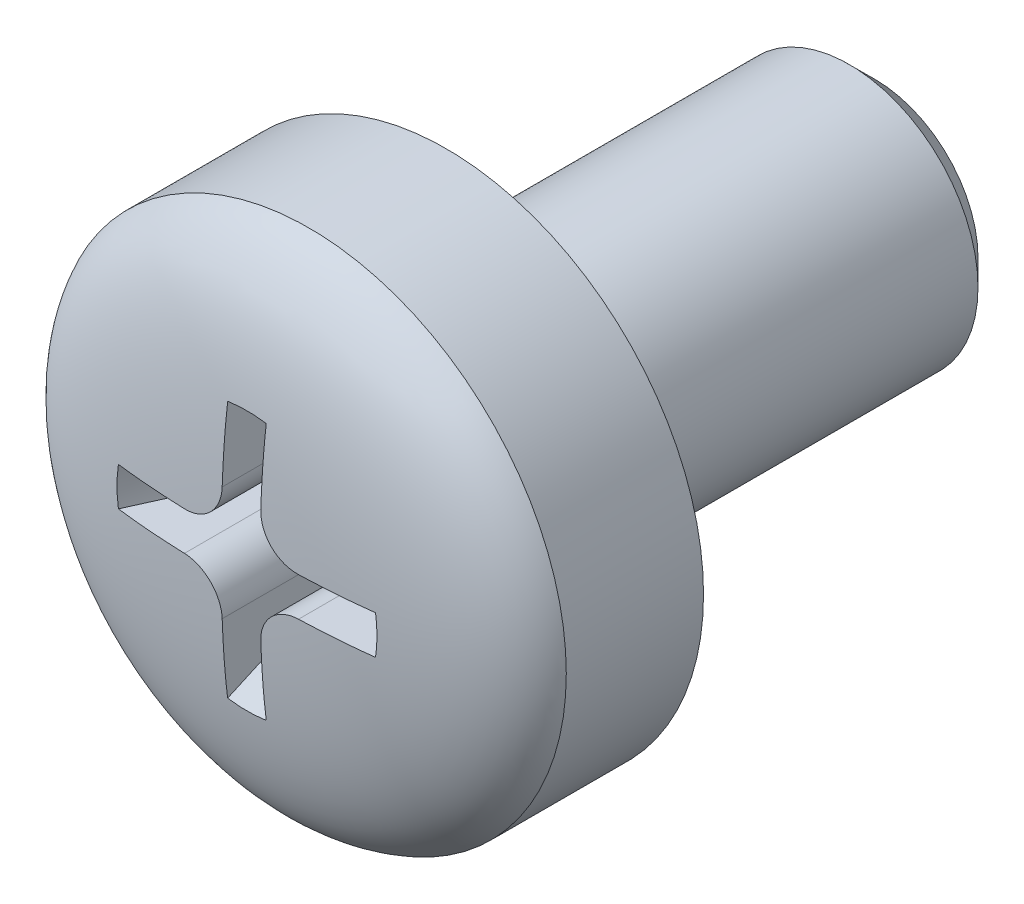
ISO-10303-21;
HEADER;
FILE_DESCRIPTION(('STEP AP214'),'2;1');
FILE_NAME('part.step','',(''),(''),'','','');
FILE_SCHEMA(('AUTOMOTIVE_DESIGN { 1 0 10303 214 1 1 1 1 }'));
ENDSEC;
DATA;
#1=APPLICATION_CONTEXT('core data for automotive mechanical design processes');
#2=APPLICATION_PROTOCOL_DEFINITION('international standard','automotive_design',2000,#1);
#3=PRODUCT_CONTEXT('',#1,'mechanical');
#4=PRODUCT('Part','Part','',(#3));
#5=PRODUCT_RELATED_PRODUCT_CATEGORY('part','',(#4));
#6=PRODUCT_DEFINITION_FORMATION('','',#4);
#7=PRODUCT_DEFINITION_CONTEXT('part definition',#1,'design');
#8=PRODUCT_DEFINITION('design','',#6,#7);
#9=PRODUCT_DEFINITION_SHAPE('','',#8);
#10=(LENGTH_UNIT() NAMED_UNIT(*) SI_UNIT(.MILLI.,.METRE.));
#11=(NAMED_UNIT(*) PLANE_ANGLE_UNIT() SI_UNIT($,.RADIAN.));
#12=(NAMED_UNIT(*) SI_UNIT($,.STERADIAN.) SOLID_ANGLE_UNIT());
#13=UNCERTAINTY_MEASURE_WITH_UNIT(LENGTH_MEASURE(1.E-05),#10,'distance_accuracy_value','');
#14=(GEOMETRIC_REPRESENTATION_CONTEXT(3) GLOBAL_UNCERTAINTY_ASSIGNED_CONTEXT((#13)) GLOBAL_UNIT_ASSIGNED_CONTEXT((#10,
#11,#12)) REPRESENTATION_CONTEXT('',''));
#15=CARTESIAN_POINT('',(0.,0.,0.));
#16=DIRECTION('',(0.,0.,1.));
#17=DIRECTION('',(1.,0.,0.));
#18=AXIS2_PLACEMENT_3D('',#15,#16,#17);
#19=CARTESIAN_POINT('',(0.,0.,0.4));
#20=DIRECTION('',(0.,0.,1.));
#21=DIRECTION('',(1.,0.,0.));
#22=AXIS2_PLACEMENT_3D('',#19,#20,#21);
#23=PLANE('',#22);
#24=CARTESIAN_POINT('',(0.,0.,0.4));
#25=DIRECTION('',(0.,0.,1.));
#26=DIRECTION('',(1.,0.,0.));
#27=AXIS2_PLACEMENT_3D('',#24,#25,#26);
#28=CIRCLE('',#27,0.66);
#29=CARTESIAN_POINT('',(0.619607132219,-0.227347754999,0.4));
#30=VERTEX_POINT('',#29);
#31=CARTESIAN_POINT('',(0.66,0.,0.4));
#32=VERTEX_POINT('',#31);
#33=EDGE_CURVE('E411',#30,#32,#28,.T.);
#34=ORIENTED_EDGE('',*,*,#33,.T.);
#35=CARTESIAN_POINT('',(0.,0.,0.4));
#36=DIRECTION('',(0.,0.,1.));
#37=DIRECTION('',(1.,0.,0.));
#38=AXIS2_PLACEMENT_3D('',#35,#36,#37);
#39=CIRCLE('',#38,0.66);
#40=CARTESIAN_POINT('',(0.619607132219,0.227347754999,0.4));
#41=VERTEX_POINT('',#40);
#42=EDGE_CURVE('E10',#32,#41,#39,.T.);
#43=ORIENTED_EDGE('',*,*,#42,.T.);
#44=CARTESIAN_POINT('',(0.665,0.665,0.4));
#45=DIRECTION('',(0.,0.,1.));
#46=DIRECTION('',(1.,0.,0.));
#47=AXIS2_PLACEMENT_3D('',#44,#45,#46);
#48=CIRCLE('',#47,0.44);
#49=CARTESIAN_POINT('',(0.227347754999,0.619607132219,0.4));
#50=VERTEX_POINT('',#49);
#51=EDGE_CURVE('E509',#50,#41,#48,.T.);
#52=ORIENTED_EDGE('',*,*,#51,.F.);
#53=CARTESIAN_POINT('',(0.,0.,0.4));
#54=DIRECTION('',(0.,0.,1.));
#55=DIRECTION('',(1.,0.,0.));
#56=AXIS2_PLACEMENT_3D('',#53,#54,#55);
#57=CIRCLE('',#56,0.66);
#58=CARTESIAN_POINT('',(-0.227347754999,0.619607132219,0.4));
#59=VERTEX_POINT('',#58);
#60=EDGE_CURVE('E458',#50,#59,#57,.T.);
#61=ORIENTED_EDGE('',*,*,#60,.T.);
#62=CARTESIAN_POINT('',(-0.665,0.665,0.4));
#63=DIRECTION('',(0.,0.,1.));
#64=DIRECTION('',(1.,0.,0.));
#65=AXIS2_PLACEMENT_3D('',#62,#63,#64);
#66=CIRCLE('',#65,0.44);
#67=CARTESIAN_POINT('',(-0.619607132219,0.227347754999,0.4));
#68=VERTEX_POINT('',#67);
#69=EDGE_CURVE('E493',#68,#59,#66,.T.);
#70=ORIENTED_EDGE('',*,*,#69,.F.);
#71=CARTESIAN_POINT('',(0.,0.,0.4));
#72=DIRECTION('',(0.,0.,1.));
#73=DIRECTION('',(1.,0.,0.));
#74=AXIS2_PLACEMENT_3D('',#71,#72,#73);
#75=CIRCLE('',#74,0.66);
#76=CARTESIAN_POINT('',(-0.619607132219,-0.227347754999,0.4));
#77=VERTEX_POINT('',#76);
#78=EDGE_CURVE('E282',#68,#77,#75,.T.);
#79=ORIENTED_EDGE('',*,*,#78,.T.);
#80=CARTESIAN_POINT('',(-0.665,-0.665,0.4));
#81=DIRECTION('',(0.,0.,1.));
#82=DIRECTION('',(1.,0.,0.));
#83=AXIS2_PLACEMENT_3D('',#80,#81,#82);
#84=CIRCLE('',#83,0.44);
#85=CARTESIAN_POINT('',(-0.227347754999,-0.619607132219,0.4));
#86=VERTEX_POINT('',#85);
#87=EDGE_CURVE('E369',#86,#77,#84,.T.);
#88=ORIENTED_EDGE('',*,*,#87,.F.);
#89=CARTESIAN_POINT('',(0.,0.,0.4));
#90=DIRECTION('',(0.,0.,1.));
#91=DIRECTION('',(1.,0.,0.));
#92=AXIS2_PLACEMENT_3D('',#89,#90,#91);
#93=CIRCLE('',#92,0.66);
#94=CARTESIAN_POINT('',(0.227347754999,-0.619607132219,0.4));
#95=VERTEX_POINT('',#94);
#96=EDGE_CURVE('E435',#86,#95,#93,.T.);
#97=ORIENTED_EDGE('',*,*,#96,.T.);
#98=CARTESIAN_POINT('',(0.665,-0.665,0.4));
#99=DIRECTION('',(0.,0.,1.));
#100=DIRECTION('',(1.,0.,0.));
#101=AXIS2_PLACEMENT_3D('',#98,#99,#100);
#102=CIRCLE('',#101,0.44);
#103=EDGE_CURVE('E420',#30,#95,#102,.T.);
#104=ORIENTED_EDGE('',*,*,#103,.F.);
#105=EDGE_LOOP('',(#34,#43,#52,#61,#70,#79,#88,#97,#104));
#106=FACE_BOUND('',#105,.T.);
#107=ADVANCED_FACE('F16',(#106),#23,.T.);
#108=CARTESIAN_POINT('',(0.,0.,0.4));
#109=DIRECTION('',(0.,0.,1.));
#110=DIRECTION('',(1.,0.,0.));
#111=AXIS2_PLACEMENT_3D('',#108,#109,#110);
#112=CONICAL_SURFACE('',#111,0.66,0.418688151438);
#113=CARTESIAN_POINT('',(0.665000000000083,0.225,0.494455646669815));
#114=CARTESIAN_POINT('',(0.928989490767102,0.225,1.05639686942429));
#115=CARTESIAN_POINT('',(1.49897087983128,0.225,2.32306383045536));
#116=(BOUNDED_CURVE() B_SPLINE_CURVE(2,(#113,#114,#115),.UNSPECIFIED.,.F.,
.F.) B_SPLINE_CURVE_WITH_KNOTS((3,3),(0.,1.),
.UNSPECIFIED.) CURVE() GEOMETRIC_REPRESENTATION_ITEM() RATIONAL_B_SPLINE_CURVE((1.,
1.07920837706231,1.)) REPRESENTATION_ITEM(''));
#117=CARTESIAN_POINT('',(0.665,0.225,0.49445564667));
#118=VERTEX_POINT('',#117);
#119=CARTESIAN_POINT('',(1.498970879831,0.225,2.323063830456));
#120=VERTEX_POINT('',#119);
#121=EDGE_CURVE('E20',#118,#120,#116,.T.);
#122=ORIENTED_EDGE('',*,*,#121,.F.);
#123=CARTESIAN_POINT('',(0.619607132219,0.227347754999,0.4));
#124=CARTESIAN_POINT('',(0.631098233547,0.226155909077,0.423319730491));
#125=CARTESIAN_POINT('',(0.642491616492,0.225380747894,0.446872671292));
#126=CARTESIAN_POINT('',(0.653791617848,0.225000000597,0.470596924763));
#127=CARTESIAN_POINT('',(0.665,0.225,0.49445564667));
#128=(BOUNDED_CURVE() B_SPLINE_CURVE(4,(#123,#124,#125,#126,#127),.UNSPECIFIED.,.F.,
.F.) B_SPLINE_CURVE_WITH_KNOTS((5,5),(0.,1.),
.UNSPECIFIED.) CURVE() GEOMETRIC_REPRESENTATION_ITEM() RATIONAL_B_SPLINE_CURVE((1.,1.,1.,1.,1.)) REPRESENTATION_ITEM(''));
#129=EDGE_CURVE('E511',#41,#118,#128,.T.);
#130=ORIENTED_EDGE('',*,*,#129,.F.);
#131=ORIENTED_EDGE('',*,*,#42,.F.);
#132=DIRECTION('',(0.406562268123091,0.,0.913623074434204));
#133=VECTOR('',#132,1.);
#134=CARTESIAN_POINT('',(0.66,0.,0.4));
#135=LINE('',#134,#133);
#136=CARTESIAN_POINT('',(1.515763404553,0.,2.323063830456));
#137=VERTEX_POINT('',#136);
#138=EDGE_CURVE('E404',#32,#137,#135,.T.);
#139=ORIENTED_EDGE('',*,*,#138,.T.);
#140=CARTESIAN_POINT('',(1.42299669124,0.522129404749,2.323063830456));
#141=CARTESIAN_POINT('',(1.459719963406,0.422044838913,2.323063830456));
#142=CARTESIAN_POINT('',(1.487644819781,0.318729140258,2.323063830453));
#143=CARTESIAN_POINT('',(1.506390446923,0.213221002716,2.323063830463));
#144=CARTESIAN_POINT('',(1.515763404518,0.106609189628,2.323063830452));
#145=CARTESIAN_POINT('',(1.515763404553,0.,2.323063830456));
#146=(BOUNDED_CURVE() B_SPLINE_CURVE(5,(#140,#141,#142,#143,#144,#145),.UNSPECIFIED.,.F.,
.F.) B_SPLINE_CURVE_WITH_KNOTS((6,6),(0.,1.),
.UNSPECIFIED.) CURVE() GEOMETRIC_REPRESENTATION_ITEM() RATIONAL_B_SPLINE_CURVE((1.,1.,1.,1.,1.,1.)) REPRESENTATION_ITEM(''));
#147=EDGE_CURVE('E357',#120,#137,#146,.T.);
#148=ORIENTED_EDGE('',*,*,#147,.F.);
#149=EDGE_LOOP('',(#122,#130,#131,#139,#148));
#150=FACE_BOUND('',#149,.T.);
#151=ADVANCED_FACE('F18',(#150),#112,.F.);
#152=CARTESIAN_POINT('',(0.665,0.225,0.4));
#153=DIRECTION('',(0.,1.,0.));
#154=DIRECTION('',(1.,0.,0.));
#155=AXIS2_PLACEMENT_3D('',#152,#153,#154);
#156=PLANE('',#155);
#157=CARTESIAN_POINT('',(0.665,0.225,2.386872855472));
#158=CARTESIAN_POINT('',(0.726071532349,0.225,2.384557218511));
#159=CARTESIAN_POINT('',(0.788941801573,0.225,2.381864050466));
#160=CARTESIAN_POINT('',(0.852957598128,0.225,2.37876353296));
#161=CARTESIAN_POINT('',(0.917614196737,0.225,2.375230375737));
#162=CARTESIAN_POINT('',(0.982606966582,0.225,2.371239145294));
#163=CARTESIAN_POINT('',(1.047787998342,0.225,2.36675746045));
#164=CARTESIAN_POINT('',(1.157160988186,0.225,2.358350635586));
#165=CARTESIAN_POINT('',(1.201209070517,0.225,2.354725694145));
#166=CARTESIAN_POINT('',(1.245282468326,0.225,2.350844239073));
#167=CARTESIAN_POINT('',(1.289356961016,0.225,2.346692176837));
#168=CARTESIAN_POINT('',(1.333412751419,0.225,2.342254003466));
#169=CARTESIAN_POINT('',(1.377433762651,0.225,2.337512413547));
#170=CARTESIAN_POINT('',(1.437455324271,0.225,2.330599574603));
#171=CARTESIAN_POINT('',(1.453497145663,0.225,2.328708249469));
#172=CARTESIAN_POINT('',(1.469531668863,0.225,2.326773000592));
#173=CARTESIAN_POINT('',(1.485558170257,0.225,2.324792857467));
#174=CARTESIAN_POINT('',(1.501575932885,0.225,2.322766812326));
#175=CARTESIAN_POINT('',(1.517584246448,0.225,2.32069382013));
#176=CARTESIAN_POINT('',(1.533582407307,0.225,2.318572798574));
#177=(BOUNDED_CURVE() B_SPLINE_CURVE(7,(#157,#158,#159,#160,#161,#162,#163,#164,#165,#166,#167,
#168,#169,#170,#171,#172,#173,#174,#175,#176),.UNSPECIFIED.,.F.,
.F.) B_SPLINE_CURVE_WITH_KNOTS((8,6,6,8),(0.,0.521248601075,0.871992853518,1.),
.UNSPECIFIED.) CURVE() GEOMETRIC_REPRESENTATION_ITEM() RATIONAL_B_SPLINE_CURVE((1.,1.,1.,1.,1.,
1.,1.,1.,1.,1.,1.,1.,1.,1.,1.,1.,1.,1.,1.,1.)) REPRESENTATION_ITEM(''));
#178=CARTESIAN_POINT('',(0.665,0.225,2.386872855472));
#179=VERTEX_POINT('',#178);
#180=EDGE_CURVE('E350',#179,#120,#177,.T.);
#181=ORIENTED_EDGE('',*,*,#180,.F.);
#182=DIRECTION('',(0.,0.,1.));
#183=VECTOR('',#182,1.);
#184=CARTESIAN_POINT('',(0.665,0.225,0.4));
#185=LINE('',#184,#183);
#186=EDGE_CURVE('E516',#118,#179,#185,.T.);
#187=ORIENTED_EDGE('',*,*,#186,.F.);
#188=ORIENTED_EDGE('',*,*,#121,.T.);
#189=EDGE_LOOP('',(#181,#187,#188));
#190=FACE_BOUND('',#189,.T.);
#191=ADVANCED_FACE('F620',(#190),#156,.F.);
#192=CARTESIAN_POINT('',(0.665,0.665,0.4));
#193=DIRECTION('',(0.,0.,-1.));
#194=DIRECTION('',(1.,0.,0.));
#195=AXIS2_PLACEMENT_3D('',#192,#193,#194);
#196=CYLINDRICAL_SURFACE('',#195,0.44);
#197=ORIENTED_EDGE('',*,*,#51,.T.);
#198=ORIENTED_EDGE('',*,*,#129,.T.);
#199=ORIENTED_EDGE('',*,*,#186,.T.);
#200=CARTESIAN_POINT('',(0.353873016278,0.353873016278,2.393543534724));
#201=CARTESIAN_POINT('',(0.37187081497,0.335875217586,2.393543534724));
#202=CARTESIAN_POINT('',(0.391072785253,0.319102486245,2.393457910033));
#203=CARTESIAN_POINT('',(0.411602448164,0.303426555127,2.393286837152));
#204=CARTESIAN_POINT('',(0.433623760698,0.288838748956,2.393024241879));
#205=CARTESIAN_POINT('',(0.457308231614,0.275435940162,2.39265960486));
#206=CARTESIAN_POINT('',(0.48275831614,0.263468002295,2.392178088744));
#207=CARTESIAN_POINT('',(0.529863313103,0.245721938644,2.391118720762));
#208=CARTESIAN_POINT('',(0.550753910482,0.239143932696,2.390599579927));
#209=CARTESIAN_POINT('',(0.572481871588,0.233654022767,2.390006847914));
#210=CARTESIAN_POINT('',(0.594939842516,0.22939095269,2.389337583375));
#211=CARTESIAN_POINT('',(0.617975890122,0.226476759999,2.388590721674));
#212=CARTESIAN_POINT('',(0.641399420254,0.225,2.387767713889));
#213=CARTESIAN_POINT('',(0.665,0.225,2.386872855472));
#214=(BOUNDED_CURVE() B_SPLINE_CURVE(7,(#200,#201,#202,#203,#204,#205,#206,#207,#208,#209,#210,
#211,#212,#213),.UNSPECIFIED.,.F.,.F.) B_SPLINE_CURVE_WITH_KNOTS((8,6,8),(0.,0.575767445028,1.),
.UNSPECIFIED.) CURVE() GEOMETRIC_REPRESENTATION_ITEM() RATIONAL_B_SPLINE_CURVE((1.,1.,1.,1.,1.,
1.,1.,1.,1.,1.,1.,1.,1.,1.)) REPRESENTATION_ITEM(''));
#215=CARTESIAN_POINT('',(0.353873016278,0.353873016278,2.393543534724));
#216=VERTEX_POINT('',#215);
#217=EDGE_CURVE('E336',#216,#179,#214,.T.);
#218=ORIENTED_EDGE('',*,*,#217,.F.);
#219=CARTESIAN_POINT('',(0.225,0.665,2.386872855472));
#220=CARTESIAN_POINT('',(0.225,0.651787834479,2.387373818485));
#221=CARTESIAN_POINT('',(0.225476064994,0.638637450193,2.387851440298));
#222=CARTESIAN_POINT('',(0.226419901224,0.625585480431,2.388305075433));
#223=CARTESIAN_POINT('',(0.227818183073,0.61266787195,2.388734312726));
#224=CARTESIAN_POINT('',(0.22965303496,0.599918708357,2.389138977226));
#225=CARTESIAN_POINT('',(0.236604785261,0.561135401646,2.390313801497));
#226=CARTESIAN_POINT('',(0.243121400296,0.53575915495,2.391001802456));
#227=CARTESIAN_POINT('',(0.251251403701,0.51155486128,2.391582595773));
#228=CARTESIAN_POINT('',(0.260721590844,0.488669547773,2.392064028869));
#229=CARTESIAN_POINT('',(0.271319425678,0.467107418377,2.39245553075));
#230=CARTESIAN_POINT('',(0.293000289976,0.429138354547,2.393035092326));
#231=CARTESIAN_POINT('',(0.303848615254,0.412419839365,2.393242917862));
#232=CARTESIAN_POINT('',(0.315369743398,0.396608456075,2.393394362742));
#233=CARTESIAN_POINT('',(0.327531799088,0.381625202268,2.393493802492));
#234=CARTESIAN_POINT('',(0.34034822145,0.367397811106,2.393543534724));
#235=CARTESIAN_POINT('',(0.353873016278,0.353873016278,2.393543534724));
#236=(BOUNDED_CURVE() B_SPLINE_CURVE(6,(#219,#220,#221,#222,#223,#224,#225,#226,#227,#228,#229,
#230,#231,#232,#233,#234,#235),.UNSPECIFIED.,.F.,.F.) B_SPLINE_CURVE_WITH_KNOTS((7,5,5,7),(0.,
0.203585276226,0.629156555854,1.),
.UNSPECIFIED.) CURVE() GEOMETRIC_REPRESENTATION_ITEM() RATIONAL_B_SPLINE_CURVE((1.,1.,1.,1.,1.,
1.,1.,1.,1.,1.,1.,1.,1.,1.,1.,1.,1.)) REPRESENTATION_ITEM(''));
#237=CARTESIAN_POINT('',(0.225,0.665,2.386872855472));
#238=VERTEX_POINT('',#237);
#239=EDGE_CURVE('E330',#238,#216,#236,.T.);
#240=ORIENTED_EDGE('',*,*,#239,.F.);
#241=DIRECTION('',(0.,0.,1.));
#242=VECTOR('',#241,1.);
#243=CARTESIAN_POINT('',(0.225,0.665,0.4));
#244=LINE('',#243,#242);
#245=CARTESIAN_POINT('',(0.225,0.665,0.49445564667));
#246=VERTEX_POINT('',#245);
#247=EDGE_CURVE('E508',#246,#238,#244,.T.);
#248=ORIENTED_EDGE('',*,*,#247,.F.);
#249=CARTESIAN_POINT('',(0.225,0.665,0.49445564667));
#250=CARTESIAN_POINT('',(0.225000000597,0.653791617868,0.470596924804));
#251=CARTESIAN_POINT('',(0.22538074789,0.642491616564,0.446872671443));
#252=CARTESIAN_POINT('',(0.226155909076,0.631098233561,0.42331973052));
#253=CARTESIAN_POINT('',(0.227347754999,0.619607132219,0.4));
#254=(BOUNDED_CURVE() B_SPLINE_CURVE(4,(#249,#250,#251,#252,#253),.UNSPECIFIED.,.F.,
.F.) B_SPLINE_CURVE_WITH_KNOTS((5,5),(0.,1.),
.UNSPECIFIED.) CURVE() GEOMETRIC_REPRESENTATION_ITEM() RATIONAL_B_SPLINE_CURVE((1.,1.,1.,1.,1.)) REPRESENTATION_ITEM(''));
#255=EDGE_CURVE('E496',#246,#50,#254,.T.);
#256=ORIENTED_EDGE('',*,*,#255,.T.);
#257=EDGE_LOOP('',(#197,#198,#199,#218,#240,#248,#256));
#258=FACE_BOUND('',#257,.T.);
#259=ADVANCED_FACE('F614',(#258),#196,.T.);
#260=CARTESIAN_POINT('',(0.225,1.55,0.4));
#261=DIRECTION('',(1.,0.,0.));
#262=DIRECTION('',(0.,1.,0.));
#263=AXIS2_PLACEMENT_3D('',#260,#261,#262);
#264=PLANE('',#263);
#265=ORIENTED_EDGE('',*,*,#247,.T.);
#266=CARTESIAN_POINT('',(0.225,1.533582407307,2.318572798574));
#267=CARTESIAN_POINT('',(0.225,1.430393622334,2.332253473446));
#268=CARTESIAN_POINT('',(0.225,1.326988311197,2.34390866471));
#269=CARTESIAN_POINT('',(0.225,1.22328114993,2.353880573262));
#270=CARTESIAN_POINT('',(0.225,1.11938974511,2.362376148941));
#271=CARTESIAN_POINT('',(0.225,1.015681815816,2.369556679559));
#272=CARTESIAN_POINT('',(0.225,0.912803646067,2.375556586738));
#273=CARTESIAN_POINT('',(0.225,0.790508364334,2.381552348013));
#274=CARTESIAN_POINT('',(0.225,0.769233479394,2.382552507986));
#275=CARTESIAN_POINT('',(0.225,0.748072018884,2.383506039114));
#276=CARTESIAN_POINT('',(0.225,0.727043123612,2.384413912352));
#277=CARTESIAN_POINT('',(0.225,0.706169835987,2.385277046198));
#278=CARTESIAN_POINT('',(0.225,0.685478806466,2.386096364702));
#279=CARTESIAN_POINT('',(0.225,0.665,2.386872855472));
#280=(BOUNDED_CURVE() B_SPLINE_CURVE(7,(#266,#267,#268,#269,#270,#271,#272,#273,#274,#275,#276,
#277,#278,#279),.UNSPECIFIED.,.F.,.F.) B_SPLINE_CURVE_WITH_KNOTS((8,6,8),(0.,0.825231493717,1.),
.UNSPECIFIED.) CURVE() GEOMETRIC_REPRESENTATION_ITEM() RATIONAL_B_SPLINE_CURVE((1.,1.,1.,1.,1.,
1.,1.,1.,1.,1.,1.,1.,1.,1.)) REPRESENTATION_ITEM(''));
#281=CARTESIAN_POINT('',(0.225,1.498970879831,2.323063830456));
#282=VERTEX_POINT('',#281);
#283=EDGE_CURVE('E318',#282,#238,#280,.T.);
#284=ORIENTED_EDGE('',*,*,#283,.F.);
#285=CARTESIAN_POINT('',(0.225,1.49897087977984,2.32306383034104));
#286=CARTESIAN_POINT('',(0.225,0.928989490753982,1.05639686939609));
#287=CARTESIAN_POINT('',(0.225,0.664999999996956,0.494455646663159));
#288=(BOUNDED_CURVE() B_SPLINE_CURVE(2,(#285,#286,#287),.UNSPECIFIED.,.F.,
.F.) B_SPLINE_CURVE_WITH_KNOTS((3,3),(0.,1.),
.UNSPECIFIED.) CURVE() GEOMETRIC_REPRESENTATION_ITEM() RATIONAL_B_SPLINE_CURVE((1.,
1.07920837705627,1.)) REPRESENTATION_ITEM(''));
#289=EDGE_CURVE('E498',#282,#246,#288,.T.);
#290=ORIENTED_EDGE('',*,*,#289,.T.);
#291=EDGE_LOOP('',(#265,#284,#290));
#292=FACE_BOUND('',#291,.T.);
#293=ADVANCED_FACE('F613',(#292),#264,.F.);
#294=CARTESIAN_POINT('',(0.,0.,0.4));
#295=DIRECTION('',(0.,0.,1.));
#296=DIRECTION('',(1.,0.,0.));
#297=AXIS2_PLACEMENT_3D('',#294,#295,#296);
#298=CONICAL_SURFACE('',#297,0.66,0.418688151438);
#299=CARTESIAN_POINT('',(-0.225,0.665000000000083,0.494455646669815));
#300=CARTESIAN_POINT('',(-0.225,0.928989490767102,1.05639686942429));
#301=CARTESIAN_POINT('',(-0.225,1.49897087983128,2.32306383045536));
#302=(BOUNDED_CURVE() B_SPLINE_CURVE(2,(#299,#300,#301),.UNSPECIFIED.,.F.,
.F.) B_SPLINE_CURVE_WITH_KNOTS((3,3),(0.,1.),
.UNSPECIFIED.) CURVE() GEOMETRIC_REPRESENTATION_ITEM() RATIONAL_B_SPLINE_CURVE((1.,
1.07920837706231,1.)) REPRESENTATION_ITEM(''));
#303=CARTESIAN_POINT('',(-0.225,0.665,0.49445564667));
#304=VERTEX_POINT('',#303);
#305=CARTESIAN_POINT('',(-0.225,1.498970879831,2.323063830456));
#306=VERTEX_POINT('',#305);
#307=EDGE_CURVE('E439',#304,#306,#302,.T.);
#308=ORIENTED_EDGE('',*,*,#307,.F.);
#309=CARTESIAN_POINT('',(-0.227347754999,0.619607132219,0.4));
#310=CARTESIAN_POINT('',(-0.22615590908,0.631098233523,0.423319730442));
#311=CARTESIAN_POINT('',(-0.225380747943,0.642491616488,0.446872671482));
#312=CARTESIAN_POINT('',(-0.225000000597,0.653791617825,0.470596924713));
#313=CARTESIAN_POINT('',(-0.225,0.665,0.49445564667));
#314=(BOUNDED_CURVE() B_SPLINE_CURVE(4,(#309,#310,#311,#312,#313),.UNSPECIFIED.,.F.,
.F.) B_SPLINE_CURVE_WITH_KNOTS((5,5),(0.,1.),
.UNSPECIFIED.) CURVE() GEOMETRIC_REPRESENTATION_ITEM() RATIONAL_B_SPLINE_CURVE((1.,1.,1.,1.,1.)) REPRESENTATION_ITEM(''));
#315=EDGE_CURVE('E436',#59,#304,#314,.T.);
#316=ORIENTED_EDGE('',*,*,#315,.F.);
#317=ORIENTED_EDGE('',*,*,#60,.F.);
#318=ORIENTED_EDGE('',*,*,#255,.F.);
#319=ORIENTED_EDGE('',*,*,#289,.F.);
#320=CARTESIAN_POINT('',(-0.522129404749,1.42299669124,2.323063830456));
#321=CARTESIAN_POINT('',(-0.355335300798,1.484197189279,2.323063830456));
#322=CARTESIAN_POINT('',(-0.179878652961,1.521956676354,2.323063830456));
#323=CARTESIAN_POINT('',(0.,1.534689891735,2.323063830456));
#324=CARTESIAN_POINT('',(0.179878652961,1.521956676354,2.323063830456));
#325=CARTESIAN_POINT('',(0.355335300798,1.484197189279,2.323063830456));
#326=CARTESIAN_POINT('',(0.522129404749,1.42299669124,2.323063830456));
#327=(BOUNDED_CURVE() B_SPLINE_CURVE(6,(#320,#321,#322,#323,#324,#325,#326),.UNSPECIFIED.,.F.,
.F.) B_SPLINE_CURVE_WITH_KNOTS((7,7),(0.,1.),
.UNSPECIFIED.) CURVE() GEOMETRIC_REPRESENTATION_ITEM() RATIONAL_B_SPLINE_CURVE((1.,1.,1.,1.,1.,
1.,1.)) REPRESENTATION_ITEM(''));
#328=EDGE_CURVE('E302',#306,#282,#327,.T.);
#329=ORIENTED_EDGE('',*,*,#328,.F.);
#330=EDGE_LOOP('',(#308,#316,#317,#318,#319,#329));
#331=FACE_BOUND('',#330,.T.);
#332=ADVANCED_FACE('F610',(#331),#298,.F.);
#333=CARTESIAN_POINT('',(-0.225,0.665,0.4));
#334=DIRECTION('',(-1.,0.,0.));
#335=DIRECTION('',(0.,0.,1.));
#336=AXIS2_PLACEMENT_3D('',#333,#334,#335);
#337=PLANE('',#336);
#338=CARTESIAN_POINT('',(-0.225,0.665,2.386872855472));
#339=CARTESIAN_POINT('',(-0.225,0.726071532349,2.384557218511));
#340=CARTESIAN_POINT('',(-0.225,0.788941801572,2.381864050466));
#341=CARTESIAN_POINT('',(-0.225,0.852957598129,2.37876353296));
#342=CARTESIAN_POINT('',(-0.225,0.917614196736,2.375230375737));
#343=CARTESIAN_POINT('',(-0.225,0.982606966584,2.371239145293));
#344=CARTESIAN_POINT('',(-0.225,1.047787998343,2.36675746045));
#345=CARTESIAN_POINT('',(-0.225,1.157160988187,2.358350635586));
#346=CARTESIAN_POINT('',(-0.225,1.201209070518,2.354725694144));
#347=CARTESIAN_POINT('',(-0.225,1.245282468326,2.350844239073));
#348=CARTESIAN_POINT('',(-0.225,1.289356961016,2.346692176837));
#349=CARTESIAN_POINT('',(-0.225,1.333412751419,2.342254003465));
#350=CARTESIAN_POINT('',(-0.225,1.377433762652,2.337512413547));
#351=CARTESIAN_POINT('',(-0.225,1.437455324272,2.330599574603));
#352=CARTESIAN_POINT('',(-0.225,1.453497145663,2.328708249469));
#353=CARTESIAN_POINT('',(-0.225,1.469531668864,2.326773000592));
#354=CARTESIAN_POINT('',(-0.225,1.485558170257,2.324792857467));
#355=CARTESIAN_POINT('',(-0.225,1.501575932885,2.322766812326));
#356=CARTESIAN_POINT('',(-0.225,1.517584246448,2.32069382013));
#357=CARTESIAN_POINT('',(-0.225,1.533582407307,2.318572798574));
#358=(BOUNDED_CURVE() B_SPLINE_CURVE(7,(#338,#339,#340,#341,#342,#343,#344,#345,#346,#347,#348,
#349,#350,#351,#352,#353,#354,#355,#356,#357),.UNSPECIFIED.,.F.,
.F.) B_SPLINE_CURVE_WITH_KNOTS((8,6,6,8),(0.,0.521248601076,0.871992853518,1.),
.UNSPECIFIED.) CURVE() GEOMETRIC_REPRESENTATION_ITEM() RATIONAL_B_SPLINE_CURVE((1.,1.,1.,1.,1.,
1.,1.,1.,1.,1.,1.,1.,1.,1.,1.,1.,1.,1.,1.,1.)) REPRESENTATION_ITEM(''));
#359=CARTESIAN_POINT('',(-0.225,0.665,2.386872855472));
#360=VERTEX_POINT('',#359);
#361=EDGE_CURVE('E292',#360,#306,#358,.T.);
#362=ORIENTED_EDGE('',*,*,#361,.F.);
#363=DIRECTION('',(0.,0.,1.));
#364=VECTOR('',#363,1.);
#365=CARTESIAN_POINT('',(-0.225,0.665,0.4));
#366=LINE('',#365,#364);
#367=EDGE_CURVE('E431',#304,#360,#366,.T.);
#368=ORIENTED_EDGE('',*,*,#367,.F.);
#369=ORIENTED_EDGE('',*,*,#307,.T.);
#370=EDGE_LOOP('',(#362,#368,#369));
#371=FACE_BOUND('',#370,.T.);
#372=ADVANCED_FACE('F605',(#371),#337,.F.);
#373=CARTESIAN_POINT('',(-0.665,0.665,0.4));
#374=DIRECTION('',(0.,0.,-1.));
#375=DIRECTION('',(1.,0.,0.));
#376=AXIS2_PLACEMENT_3D('',#373,#374,#375);
#377=CYLINDRICAL_SURFACE('',#376,0.44);
#378=ORIENTED_EDGE('',*,*,#69,.T.);
#379=ORIENTED_EDGE('',*,*,#315,.T.);
#380=ORIENTED_EDGE('',*,*,#367,.T.);
#381=CARTESIAN_POINT('',(-0.665,0.225,2.386872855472));
#382=CARTESIAN_POINT('',(-0.653665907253,0.225,2.387302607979));
#383=CARTESIAN_POINT('',(-0.642376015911,0.225340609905,2.387715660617));
#384=CARTESIAN_POINT('',(-0.631151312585,0.226017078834,2.388111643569));
#385=CARTESIAN_POINT('',(-0.620012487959,0.227022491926,2.388490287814));
#386=CARTESIAN_POINT('',(-0.608979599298,0.228347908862,2.38885142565));
#387=CARTESIAN_POINT('',(-0.598071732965,0.229982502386,2.389194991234));
#388=CARTESIAN_POINT('',(-0.564824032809,0.235946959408,2.390201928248));
#389=CARTESIAN_POINT('',(-0.542954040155,0.241275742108,2.390806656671));
#390=CARTESIAN_POINT('',(-0.521876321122,0.247785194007,2.391334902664));
#391=CARTESIAN_POINT('',(-0.501698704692,0.25532954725,2.391789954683));
#392=CARTESIAN_POINT('',(-0.482464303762,0.263770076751,2.392176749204));
#393=CARTESIAN_POINT('',(-0.464167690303,0.272995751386,2.392500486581));
#394=CARTESIAN_POINT('',(-0.435025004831,0.28964048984,2.39294518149));
#395=CARTESIAN_POINT('',(-0.42368219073,0.29667853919,2.39309790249));
#396=CARTESIAN_POINT('',(-0.412738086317,0.304018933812,2.393225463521));
#397=CARTESIAN_POINT('',(-0.402174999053,0.311647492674,2.393329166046));
#398=CARTESIAN_POINT('',(-0.391973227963,0.319557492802,2.393410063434));
#399=CARTESIAN_POINT('',(-0.382113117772,0.32774951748,2.393468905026));
#400=CARTESIAN_POINT('',(-0.35052458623,0.355845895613,2.393592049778));
#401=CARTESIAN_POINT('',(-0.330236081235,0.376982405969,2.393562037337));
#402=CARTESIAN_POINT('',(-0.311435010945,0.399771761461,2.393421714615));
#403=CARTESIAN_POINT('',(-0.294046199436,0.424451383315,2.393164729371));
#404=CARTESIAN_POINT('',(-0.278155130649,0.451301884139,2.392777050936));
#405=CARTESIAN_POINT('',(-0.264128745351,0.480530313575,2.392235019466));
#406=CARTESIAN_POINT('',(-0.245127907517,0.531764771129,2.391071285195));
#407=CARTESIAN_POINT('',(-0.238730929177,0.552401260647,2.390554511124));
#408=CARTESIAN_POINT('',(-0.233397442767,0.573843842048,2.389966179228));
#409=CARTESIAN_POINT('',(-0.229259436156,0.59598747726,2.389303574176));
#410=CARTESIAN_POINT('',(-0.226432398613,0.618685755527,2.388565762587));
#411=CARTESIAN_POINT('',(-0.225,0.641756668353,2.387754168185));
#412=CARTESIAN_POINT('',(-0.225,0.665,2.386872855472));
#413=(BOUNDED_CURVE() B_SPLINE_CURVE(7,(#381,#382,#383,#384,#385,#386,#387,#388,#389,#390,#391,
#392,#393,#394,#395,#396,#397,#398,#399,#400,#401,#402,#403,#404,#405,#406,#407,#408,#409,#410,
#411,#412),.UNSPECIFIED.,.F.,.F.) B_SPLINE_CURVE_WITH_KNOTS((8,6,6,6,6,8),(0.,0.101877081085,
0.314645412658,0.458491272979,0.791142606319,1.),
.UNSPECIFIED.) CURVE() GEOMETRIC_REPRESENTATION_ITEM() RATIONAL_B_SPLINE_CURVE((1.,1.,1.,1.,1.,
1.,1.,1.,1.,1.,1.,1.,1.,1.,1.,1.,1.,1.,1.,1.,1.,1.,1.,1.,1.,1.,1.,1.,1.,1.,1.,1.)) REPRESENTATION_ITEM(''));
#414=CARTESIAN_POINT('',(-0.665,0.225,2.386872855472));
#415=VERTEX_POINT('',#414);
#416=EDGE_CURVE('E272',#415,#360,#413,.T.);
#417=ORIENTED_EDGE('',*,*,#416,.F.);
#418=DIRECTION('',(0.,0.,1.));
#419=VECTOR('',#418,1.);
#420=CARTESIAN_POINT('',(-0.665,0.225,0.4));
#421=LINE('',#420,#419);
#422=CARTESIAN_POINT('',(-0.665,0.225,0.49445564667));
#423=VERTEX_POINT('',#422);
#424=EDGE_CURVE('E486',#423,#415,#421,.T.);
#425=ORIENTED_EDGE('',*,*,#424,.F.);
#426=CARTESIAN_POINT('',(-0.665,0.225,0.49445564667));
#427=CARTESIAN_POINT('',(-0.653791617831,0.225000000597,0.470596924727));
#428=CARTESIAN_POINT('',(-0.642491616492,0.225380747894,0.446872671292));
#429=CARTESIAN_POINT('',(-0.631098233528,0.226155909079,0.423319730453));
#430=CARTESIAN_POINT('',(-0.619607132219,0.227347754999,0.4));
#431=(BOUNDED_CURVE() B_SPLINE_CURVE(4,(#426,#427,#428,#429,#430),.UNSPECIFIED.,.F.,
.F.) B_SPLINE_CURVE_WITH_KNOTS((5,5),(0.,1.),
.UNSPECIFIED.) CURVE() GEOMETRIC_REPRESENTATION_ITEM() RATIONAL_B_SPLINE_CURVE((1.,1.,1.,1.,1.)) REPRESENTATION_ITEM(''));
#432=EDGE_CURVE('E275',#423,#68,#431,.T.);
#433=ORIENTED_EDGE('',*,*,#432,.T.);
#434=EDGE_LOOP('',(#378,#379,#380,#417,#425,#433));
#435=FACE_BOUND('',#434,.T.);
#436=ADVANCED_FACE('F601',(#435),#377,.T.);
#437=CARTESIAN_POINT('',(-1.55,0.225,0.4));
#438=DIRECTION('',(0.,1.,0.));
#439=DIRECTION('',(1.,0.,0.));
#440=AXIS2_PLACEMENT_3D('',#437,#438,#439);
#441=PLANE('',#440);
#442=ORIENTED_EDGE('',*,*,#424,.T.);
#443=CARTESIAN_POINT('',(-1.533582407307,0.225,2.318572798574));
#444=CARTESIAN_POINT('',(-1.430393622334,0.225,2.332253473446));
#445=CARTESIAN_POINT('',(-1.326988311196,0.225,2.34390866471));
#446=CARTESIAN_POINT('',(-1.223281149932,0.225,2.353880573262));
#447=CARTESIAN_POINT('',(-1.119389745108,0.225,2.362376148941));
#448=CARTESIAN_POINT('',(-1.015681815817,0.225,2.369556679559));
#449=CARTESIAN_POINT('',(-0.912803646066,0.225,2.375556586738));
#450=CARTESIAN_POINT('',(-0.790508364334,0.225,2.381552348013));
#451=CARTESIAN_POINT('',(-0.769233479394,0.225,2.382552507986));
#452=CARTESIAN_POINT('',(-0.748072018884,0.225,2.383506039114));
#453=CARTESIAN_POINT('',(-0.727043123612,0.225,2.384413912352));
#454=CARTESIAN_POINT('',(-0.706169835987,0.225,2.385277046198));
#455=CARTESIAN_POINT('',(-0.685478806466,0.225,2.386096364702));
#456=CARTESIAN_POINT('',(-0.665,0.225,2.386872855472));
#457=(BOUNDED_CURVE() B_SPLINE_CURVE(7,(#443,#444,#445,#446,#447,#448,#449,#450,#451,#452,#453,
#454,#455,#456),.UNSPECIFIED.,.F.,.F.) B_SPLINE_CURVE_WITH_KNOTS((8,6,8),(0.,0.825231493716,1.),
.UNSPECIFIED.) CURVE() GEOMETRIC_REPRESENTATION_ITEM() RATIONAL_B_SPLINE_CURVE((1.,1.,1.,1.,1.,
1.,1.,1.,1.,1.,1.,1.,1.,1.)) REPRESENTATION_ITEM(''));
#458=CARTESIAN_POINT('',(-1.498970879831,0.225,2.323063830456));
#459=VERTEX_POINT('',#458);
#460=EDGE_CURVE('E262',#459,#415,#457,.T.);
#461=ORIENTED_EDGE('',*,*,#460,.F.);
#462=CARTESIAN_POINT('',(-1.49897087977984,0.225,2.32306383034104));
#463=CARTESIAN_POINT('',(-0.928989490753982,0.225,1.05639686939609));
#464=CARTESIAN_POINT('',(-0.664999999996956,0.225,0.494455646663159));
#465=(BOUNDED_CURVE() B_SPLINE_CURVE(2,(#462,#463,#464),.UNSPECIFIED.,.F.,
.F.) B_SPLINE_CURVE_WITH_KNOTS((3,3),(0.,1.),
.UNSPECIFIED.) CURVE() GEOMETRIC_REPRESENTATION_ITEM() RATIONAL_B_SPLINE_CURVE((1.,
1.07920837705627,1.)) REPRESENTATION_ITEM(''));
#466=EDGE_CURVE('E283',#459,#423,#465,.T.);
#467=ORIENTED_EDGE('',*,*,#466,.T.);
#468=EDGE_LOOP('',(#442,#461,#467));
#469=FACE_BOUND('',#468,.T.);
#470=ADVANCED_FACE('F600',(#469),#441,.F.);
#471=CARTESIAN_POINT('',(0.,0.,0.4));
#472=DIRECTION('',(0.,0.,1.));
#473=DIRECTION('',(1.,0.,0.));
#474=AXIS2_PLACEMENT_3D('',#471,#472,#473);
#475=CONICAL_SURFACE('',#474,0.66,0.418688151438);
#476=CARTESIAN_POINT('',(-0.665000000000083,-0.225,0.494455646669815));
#477=CARTESIAN_POINT('',(-0.928989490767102,-0.225,1.05639686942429));
#478=CARTESIAN_POINT('',(-1.49897087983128,-0.225,2.32306383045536));
#479=(BOUNDED_CURVE() B_SPLINE_CURVE(2,(#476,#477,#478),.UNSPECIFIED.,.F.,
.F.) B_SPLINE_CURVE_WITH_KNOTS((3,3),(0.,1.),
.UNSPECIFIED.) CURVE() GEOMETRIC_REPRESENTATION_ITEM() RATIONAL_B_SPLINE_CURVE((1.,
1.07920837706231,1.)) REPRESENTATION_ITEM(''));
#480=CARTESIAN_POINT('',(-0.665,-0.225,0.49445564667));
#481=VERTEX_POINT('',#480);
#482=CARTESIAN_POINT('',(-1.498970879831,-0.225,2.323063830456));
#483=VERTEX_POINT('',#482);
#484=EDGE_CURVE('E304',#481,#483,#479,.T.);
#485=ORIENTED_EDGE('',*,*,#484,.F.);
#486=CARTESIAN_POINT('',(-0.619607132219,-0.227347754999,0.4));
#487=CARTESIAN_POINT('',(-0.631098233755,-0.226155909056,0.423319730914));
#488=CARTESIAN_POINT('',(-0.642491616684,-0.225380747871,0.446872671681));
#489=CARTESIAN_POINT('',(-0.653791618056,-0.225000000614,0.470596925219));
#490=CARTESIAN_POINT('',(-0.665,-0.225,0.49445564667));
#491=(BOUNDED_CURVE() B_SPLINE_CURVE(4,(#486,#487,#488,#489,#490),.UNSPECIFIED.,.F.,
.F.) B_SPLINE_CURVE_WITH_KNOTS((5,5),(0.,1.),
.UNSPECIFIED.) CURVE() GEOMETRIC_REPRESENTATION_ITEM() RATIONAL_B_SPLINE_CURVE((1.,1.,1.,1.,1.)) REPRESENTATION_ITEM(''));
#492=EDGE_CURVE('E373',#77,#481,#491,.T.);
#493=ORIENTED_EDGE('',*,*,#492,.F.);
#494=ORIENTED_EDGE('',*,*,#78,.F.);
#495=ORIENTED_EDGE('',*,*,#432,.F.);
#496=ORIENTED_EDGE('',*,*,#466,.F.);
#497=CARTESIAN_POINT('',(-1.42299669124,-0.522129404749,2.323063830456));
#498=CARTESIAN_POINT('',(-1.484197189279,-0.355335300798,2.323063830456));
#499=CARTESIAN_POINT('',(-1.521956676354,-0.179878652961,2.323063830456));
#500=CARTESIAN_POINT('',(-1.534689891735,0.,2.323063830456));
#501=CARTESIAN_POINT('',(-1.521956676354,0.179878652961,2.323063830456));
#502=CARTESIAN_POINT('',(-1.484197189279,0.355335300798,2.323063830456));
#503=CARTESIAN_POINT('',(-1.42299669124,0.522129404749,2.323063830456));
#504=(BOUNDED_CURVE() B_SPLINE_CURVE(6,(#497,#498,#499,#500,#501,#502,#503),.UNSPECIFIED.,.F.,
.F.) B_SPLINE_CURVE_WITH_KNOTS((7,7),(0.,1.),
.UNSPECIFIED.) CURVE() GEOMETRIC_REPRESENTATION_ITEM() RATIONAL_B_SPLINE_CURVE((1.,1.,1.,1.,1.,
1.,1.)) REPRESENTATION_ITEM(''));
#505=EDGE_CURVE('E271',#483,#459,#504,.T.);
#506=ORIENTED_EDGE('',*,*,#505,.F.);
#507=EDGE_LOOP('',(#485,#493,#494,#495,#496,#506));
#508=FACE_BOUND('',#507,.T.);
#509=ADVANCED_FACE('F595',(#508),#475,.F.);
#510=CARTESIAN_POINT('',(-0.665,-0.225,0.4));
#511=DIRECTION('',(0.,-1.,0.));
#512=DIRECTION('',(0.,0.,-1.));
#513=AXIS2_PLACEMENT_3D('',#510,#511,#512);
#514=PLANE('',#513);
#515=CARTESIAN_POINT('',(-0.665,-0.225,2.386872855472));
#516=CARTESIAN_POINT('',(-0.726071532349,-0.225,2.384557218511));
#517=CARTESIAN_POINT('',(-0.788941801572,-0.225,2.381864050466));
#518=CARTESIAN_POINT('',(-0.852957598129,-0.225,2.37876353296));
#519=CARTESIAN_POINT('',(-0.917614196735,-0.225,2.375230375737));
#520=CARTESIAN_POINT('',(-0.982606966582,-0.225,2.371239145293));
#521=CARTESIAN_POINT('',(-1.047787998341,-0.225,2.36675746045));
#522=CARTESIAN_POINT('',(-1.157160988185,-0.225,2.358350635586));
#523=CARTESIAN_POINT('',(-1.201209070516,-0.225,2.354725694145));
#524=CARTESIAN_POINT('',(-1.245282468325,-0.225,2.350844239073));
#525=CARTESIAN_POINT('',(-1.289356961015,-0.225,2.346692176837));
#526=CARTESIAN_POINT('',(-1.333412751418,-0.225,2.342254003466));
#527=CARTESIAN_POINT('',(-1.377433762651,-0.225,2.337512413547));
#528=CARTESIAN_POINT('',(-1.437455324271,-0.225,2.330599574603));
#529=CARTESIAN_POINT('',(-1.453497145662,-0.225,2.328708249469));
#530=CARTESIAN_POINT('',(-1.469531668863,-0.225,2.326773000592));
#531=CARTESIAN_POINT('',(-1.485558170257,-0.225,2.324792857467));
#532=CARTESIAN_POINT('',(-1.501575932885,-0.225,2.322766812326));
#533=CARTESIAN_POINT('',(-1.517584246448,-0.225,2.32069382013));
#534=CARTESIAN_POINT('',(-1.533582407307,-0.225,2.318572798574));
#535=(BOUNDED_CURVE() B_SPLINE_CURVE(7,(#515,#516,#517,#518,#519,#520,#521,#522,#523,#524,#525,
#526,#527,#528,#529,#530,#531,#532,#533,#534),.UNSPECIFIED.,.F.,
.F.) B_SPLINE_CURVE_WITH_KNOTS((8,6,6,8),(0.,0.521248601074,0.871992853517,1.),
.UNSPECIFIED.) CURVE() GEOMETRIC_REPRESENTATION_ITEM() RATIONAL_B_SPLINE_CURVE((1.,1.,1.,1.,1.,
1.,1.,1.,1.,1.,1.,1.,1.,1.,1.,1.,1.,1.,1.,1.)) REPRESENTATION_ITEM(''));
#536=CARTESIAN_POINT('',(-0.665,-0.225,2.386872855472));
#537=VERTEX_POINT('',#536);
#538=EDGE_CURVE('E265',#537,#483,#535,.T.);
#539=ORIENTED_EDGE('',*,*,#538,.F.);
#540=DIRECTION('',(0.,0.,1.));
#541=VECTOR('',#540,1.);
#542=CARTESIAN_POINT('',(-0.665,-0.225,0.4));
#543=LINE('',#542,#541);
#544=EDGE_CURVE('E315',#481,#537,#543,.T.);
#545=ORIENTED_EDGE('',*,*,#544,.F.);
#546=ORIENTED_EDGE('',*,*,#484,.T.);
#547=EDGE_LOOP('',(#539,#545,#546));
#548=FACE_BOUND('',#547,.T.);
#549=ADVANCED_FACE('F587',(#548),#514,.F.);
#550=CARTESIAN_POINT('',(-0.665,-0.665,0.4));
#551=DIRECTION('',(0.,0.,-1.));
#552=DIRECTION('',(1.,0.,0.));
#553=AXIS2_PLACEMENT_3D('',#550,#551,#552);
#554=CYLINDRICAL_SURFACE('',#553,0.44);
#555=ORIENTED_EDGE('',*,*,#87,.T.);
#556=ORIENTED_EDGE('',*,*,#492,.T.);
#557=ORIENTED_EDGE('',*,*,#544,.T.);
#558=CARTESIAN_POINT('',(-0.225,-0.665,2.386872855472));
#559=CARTESIAN_POINT('',(-0.225,-0.65366593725,2.387302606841));
#560=CARTESIAN_POINT('',(-0.225340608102,-0.642376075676,2.38771565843));
#561=CARTESIAN_POINT('',(-0.226017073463,-0.631151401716,2.388111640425));
#562=CARTESIAN_POINT('',(-0.227022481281,-0.62001260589,2.388490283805));
#563=CARTESIAN_POINT('',(-0.228347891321,-0.608979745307,2.388851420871));
#564=CARTESIAN_POINT('',(-0.229982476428,-0.59807190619,2.389194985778));
#565=CARTESIAN_POINT('',(-0.235946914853,-0.564824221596,2.390201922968));
#566=CARTESIAN_POINT('',(-0.241275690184,-0.542954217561,2.390806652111));
#567=CARTESIAN_POINT('',(-0.24778513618,-0.521876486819,2.391334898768));
#568=CARTESIAN_POINT('',(-0.255329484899,-0.501698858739,2.391789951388));
#569=CARTESIAN_POINT('',(-0.263770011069,-0.482464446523,2.392176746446));
#570=CARTESIAN_POINT('',(-0.272995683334,-0.464167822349,2.392500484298));
#571=CARTESIAN_POINT('',(-0.2896404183,-0.43502512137,2.392945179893));
#572=CARTESIAN_POINT('',(-0.296678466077,-0.42368230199,2.393097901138));
#573=CARTESIAN_POINT('',(-0.304018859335,-0.412738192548,2.393225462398));
#574=CARTESIAN_POINT('',(-0.311647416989,-0.402175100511,2.393329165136));
#575=CARTESIAN_POINT('',(-0.319557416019,-0.391973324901,2.393410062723));
#576=CARTESIAN_POINT('',(-0.327749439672,-0.382113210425,2.393468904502));
#577=CARTESIAN_POINT('',(-0.35584575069,-0.350524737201,2.393592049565));
#578=CARTESIAN_POINT('',(-0.376982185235,-0.330236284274,2.39356203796));
#579=CARTESIAN_POINT('',(-0.39977145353,-0.311435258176,2.393421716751));
#580=CARTESIAN_POINT('',(-0.424450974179,-0.294046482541,2.393164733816));
#581=CARTESIAN_POINT('',(-0.451301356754,-0.278155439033,2.392777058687));
#582=CARTESIAN_POINT('',(-0.480529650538,-0.264129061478,2.39223503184));
#583=CARTESIAN_POINT('',(-0.531764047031,-0.245128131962,2.391071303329));
#584=CARTESIAN_POINT('',(-0.552400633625,-0.238731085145,2.390554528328));
#585=CARTESIAN_POINT('',(-0.57384332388,-0.233397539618,2.389966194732));
#586=CARTESIAN_POINT('',(-0.59598707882,-0.229259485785,2.389303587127));
#587=CARTESIAN_POINT('',(-0.618685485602,-0.226432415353,2.388565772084));
#588=CARTESIAN_POINT('',(-0.641756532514,-0.225,2.387754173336));
#589=CARTESIAN_POINT('',(-0.665,-0.225,2.386872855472));
#590=(BOUNDED_CURVE() B_SPLINE_CURVE(7,(#558,#559,#560,#561,#562,#563,#564,#565,#566,#567,#568,
#569,#570,#571,#572,#573,#574,#575,#576,#577,#578,#579,#580,#581,#582,#583,#584,#585,#586,#587,
#588,#589),.UNSPECIFIED.,.F.,.F.) B_SPLINE_CURVE_WITH_KNOTS((8,6,6,6,6,8),(0.,0.101876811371,
0.314645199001,0.458491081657,0.791141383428,1.),
.UNSPECIFIED.) CURVE() GEOMETRIC_REPRESENTATION_ITEM() RATIONAL_B_SPLINE_CURVE((1.,1.,1.,1.,1.,
1.,1.,1.,1.,1.,1.,1.,1.,1.,1.,1.,1.,1.,1.,1.,1.,1.,1.,1.,1.,1.,1.,1.,1.,1.,1.,1.)) REPRESENTATION_ITEM(''));
#591=CARTESIAN_POINT('',(-0.225,-0.665,2.386872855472));
#592=VERTEX_POINT('',#591);
#593=EDGE_CURVE('E253',#592,#537,#590,.T.);
#594=ORIENTED_EDGE('',*,*,#593,.F.);
#595=DIRECTION('',(0.,0.,1.));
#596=VECTOR('',#595,1.);
#597=CARTESIAN_POINT('',(-0.225,-0.665,0.4));
#598=LINE('',#597,#596);
#599=CARTESIAN_POINT('',(-0.225,-0.665,0.49445564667));
#600=VERTEX_POINT('',#599);
#601=EDGE_CURVE('E372',#600,#592,#598,.T.);
#602=ORIENTED_EDGE('',*,*,#601,.F.);
#603=CARTESIAN_POINT('',(-0.225,-0.665,0.49445564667));
#604=CARTESIAN_POINT('',(-0.225000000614,-0.653791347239,0.470596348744));
#605=CARTESIAN_POINT('',(-0.225380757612,-0.642491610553,0.446872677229));
#606=CARTESIAN_POINT('',(-0.22615591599,-0.631098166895,0.42331959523));
#607=CARTESIAN_POINT('',(-0.227347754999,-0.619607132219,0.4));
#608=(BOUNDED_CURVE() B_SPLINE_CURVE(4,(#603,#604,#605,#606,#607),.UNSPECIFIED.,.F.,
.F.) B_SPLINE_CURVE_WITH_KNOTS((5,5),(0.,1.),
.UNSPECIFIED.) CURVE() GEOMETRIC_REPRESENTATION_ITEM() RATIONAL_B_SPLINE_CURVE((1.,1.,1.,1.,1.)) REPRESENTATION_ITEM(''));
#609=EDGE_CURVE('E445',#600,#86,#608,.T.);
#610=ORIENTED_EDGE('',*,*,#609,.T.);
#611=EDGE_LOOP('',(#555,#556,#557,#594,#602,#610));
#612=FACE_BOUND('',#611,.T.);
#613=ADVANCED_FACE('F725',(#612),#554,.T.);
#614=CARTESIAN_POINT('',(-0.225,-1.55,0.4));
#615=DIRECTION('',(-1.,0.,0.));
#616=DIRECTION('',(0.,0.,1.));
#617=AXIS2_PLACEMENT_3D('',#614,#615,#616);
#618=PLANE('',#617);
#619=ORIENTED_EDGE('',*,*,#601,.T.);
#620=CARTESIAN_POINT('',(-0.225,-1.533582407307,2.318572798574));
#621=CARTESIAN_POINT('',(-0.225,-1.430393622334,2.332253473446));
#622=CARTESIAN_POINT('',(-0.225,-1.326988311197,2.34390866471));
#623=CARTESIAN_POINT('',(-0.225,-1.22328114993,2.353880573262));
#624=CARTESIAN_POINT('',(-0.225,-1.11938974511,2.362376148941));
#625=CARTESIAN_POINT('',(-0.225,-1.015681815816,2.369556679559));
#626=CARTESIAN_POINT('',(-0.225,-0.912803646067,2.375556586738));
#627=CARTESIAN_POINT('',(-0.225,-0.790508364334,2.381552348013));
#628=CARTESIAN_POINT('',(-0.225,-0.769233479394,2.382552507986));
#629=CARTESIAN_POINT('',(-0.225,-0.748072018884,2.383506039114));
#630=CARTESIAN_POINT('',(-0.225,-0.727043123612,2.384413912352));
#631=CARTESIAN_POINT('',(-0.225,-0.706169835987,2.385277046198));
#632=CARTESIAN_POINT('',(-0.225,-0.685478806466,2.386096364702));
#633=CARTESIAN_POINT('',(-0.225,-0.665,2.386872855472));
#634=(BOUNDED_CURVE() B_SPLINE_CURVE(7,(#620,#621,#622,#623,#624,#625,#626,#627,#628,#629,#630,
#631,#632,#633),.UNSPECIFIED.,.F.,.F.) B_SPLINE_CURVE_WITH_KNOTS((8,6,8),(0.,0.825231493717,1.),
.UNSPECIFIED.) CURVE() GEOMETRIC_REPRESENTATION_ITEM() RATIONAL_B_SPLINE_CURVE((1.,1.,1.,1.,1.,
1.,1.,1.,1.,1.,1.,1.,1.,1.)) REPRESENTATION_ITEM(''));
#635=CARTESIAN_POINT('',(-0.225,-1.498970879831,2.323063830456));
#636=VERTEX_POINT('',#635);
#637=EDGE_CURVE('E243',#636,#592,#634,.T.);
#638=ORIENTED_EDGE('',*,*,#637,.F.);
#639=CARTESIAN_POINT('',(-0.225,-1.49897087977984,2.32306383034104));
#640=CARTESIAN_POINT('',(-0.225,-0.928989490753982,1.05639686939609));
#641=CARTESIAN_POINT('',(-0.225,-0.664999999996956,0.494455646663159));
#642=(BOUNDED_CURVE() B_SPLINE_CURVE(2,(#639,#640,#641),.UNSPECIFIED.,.F.,
.F.) B_SPLINE_CURVE_WITH_KNOTS((3,3),(0.,1.),
.UNSPECIFIED.) CURVE() GEOMETRIC_REPRESENTATION_ITEM() RATIONAL_B_SPLINE_CURVE((1.,
1.07920837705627,1.)) REPRESENTATION_ITEM(''));
#643=EDGE_CURVE('E447',#636,#600,#642,.T.);
#644=ORIENTED_EDGE('',*,*,#643,.T.);
#645=EDGE_LOOP('',(#619,#638,#644));
#646=FACE_BOUND('',#645,.T.);
#647=ADVANCED_FACE('F712',(#646),#618,.F.);
#648=CARTESIAN_POINT('',(0.,0.,0.4));
#649=DIRECTION('',(0.,0.,1.));
#650=DIRECTION('',(1.,0.,0.));
#651=AXIS2_PLACEMENT_3D('',#648,#649,#650);
#652=CONICAL_SURFACE('',#651,0.66,0.418688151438);
#653=ORIENTED_EDGE('',*,*,#96,.F.);
#654=ORIENTED_EDGE('',*,*,#609,.F.);
#655=ORIENTED_EDGE('',*,*,#643,.F.);
#656=CARTESIAN_POINT('',(0.52212940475,-1.422996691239,2.323063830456));
#657=CARTESIAN_POINT('',(0.355335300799,-1.484197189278,2.323063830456));
#658=CARTESIAN_POINT('',(0.179878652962,-1.521956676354,2.323063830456));
#659=CARTESIAN_POINT('',(5.68656233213E-13,-1.534689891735,2.323063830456));
#660=CARTESIAN_POINT('',(-0.179878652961,-1.521956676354,2.323063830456));
#661=CARTESIAN_POINT('',(-0.355335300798,-1.484197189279,2.323063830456));
#662=CARTESIAN_POINT('',(-0.522129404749,-1.42299669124,2.323063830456));
#663=(BOUNDED_CURVE() B_SPLINE_CURVE(6,(#656,#657,#658,#659,#660,#661,#662),.UNSPECIFIED.,.F.,
.F.) B_SPLINE_CURVE_WITH_KNOTS((7,7),(0.,1.),
.UNSPECIFIED.) CURVE() GEOMETRIC_REPRESENTATION_ITEM() RATIONAL_B_SPLINE_CURVE((1.,1.,1.,1.,1.,
1.,1.)) REPRESENTATION_ITEM(''));
#664=CARTESIAN_POINT('',(0.225,-1.498970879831,2.323063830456));
#665=VERTEX_POINT('',#664);
#666=EDGE_CURVE('E221',#665,#636,#663,.T.);
#667=ORIENTED_EDGE('',*,*,#666,.F.);
#668=CARTESIAN_POINT('',(0.225,-0.664999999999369,0.494455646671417));
#669=CARTESIAN_POINT('',(0.225,-0.928989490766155,1.05639686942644));
#670=CARTESIAN_POINT('',(0.225,-1.49897087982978,2.32306383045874));
#671=(BOUNDED_CURVE() B_SPLINE_CURVE(2,(#668,#669,#670),.UNSPECIFIED.,.F.,
.F.) B_SPLINE_CURVE_WITH_KNOTS((3,3),(0.,1.),
.UNSPECIFIED.) CURVE() GEOMETRIC_REPRESENTATION_ITEM() RATIONAL_B_SPLINE_CURVE((1.,
1.07920837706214,1.)) REPRESENTATION_ITEM(''));
#672=CARTESIAN_POINT('',(0.225,-0.665,0.49445564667));
#673=VERTEX_POINT('',#672);
#674=EDGE_CURVE('E212',#673,#665,#671,.T.);
#675=ORIENTED_EDGE('',*,*,#674,.F.);
#676=CARTESIAN_POINT('',(0.227347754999,-0.619607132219,0.4));
#677=CARTESIAN_POINT('',(0.226155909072,-0.631098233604,0.423319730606));
#678=CARTESIAN_POINT('',(0.225380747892,-0.642491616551,0.446872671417));
#679=CARTESIAN_POINT('',(0.225000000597,-0.653791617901,0.470596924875));
#680=CARTESIAN_POINT('',(0.225,-0.665,0.49445564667));
#681=(BOUNDED_CURVE() B_SPLINE_CURVE(4,(#676,#677,#678,#679,#680),.UNSPECIFIED.,.F.,
.F.) B_SPLINE_CURVE_WITH_KNOTS((5,5),(0.,1.),
.UNSPECIFIED.) CURVE() GEOMETRIC_REPRESENTATION_ITEM() RATIONAL_B_SPLINE_CURVE((1.,1.,1.,1.,1.)) REPRESENTATION_ITEM(''));
#682=EDGE_CURVE('E210',#95,#673,#681,.T.);
#683=ORIENTED_EDGE('',*,*,#682,.F.);
#684=EDGE_LOOP('',(#653,#654,#655,#667,#675,#683));
#685=FACE_BOUND('',#684,.T.);
#686=ADVANCED_FACE('F709',(#685),#652,.F.);
#687=CARTESIAN_POINT('',(0.225,-0.665,0.4));
#688=DIRECTION('',(1.,0.,0.));
#689=DIRECTION('',(0.,1.,0.));
#690=AXIS2_PLACEMENT_3D('',#687,#688,#689);
#691=PLANE('',#690);
#692=CARTESIAN_POINT('',(0.225,-0.665,2.386872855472));
#693=CARTESIAN_POINT('',(0.225,-0.726151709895,2.384554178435));
#694=CARTESIAN_POINT('',(0.225,-0.789106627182,2.381856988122));
#695=CARTESIAN_POINT('',(0.225,-0.853209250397,2.378751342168));
#696=CARTESIAN_POINT('',(0.225,-0.917953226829,2.375211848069));
#697=CARTESIAN_POINT('',(0.225,-0.983033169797,2.371212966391));
#698=CARTESIAN_POINT('',(0.225,-1.04830098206,2.36672217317));
#699=CARTESIAN_POINT('',(0.225,-1.157753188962,2.358302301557));
#700=CARTESIAN_POINT('',(0.225,-1.201793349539,2.354675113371));
#701=CARTESIAN_POINT('',(0.225,-1.245858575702,2.350791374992));
#702=CARTESIAN_POINT('',(0.225,-1.289924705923,2.346636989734));
#703=CARTESIAN_POINT('',(0.225,-1.333971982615,2.342196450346));
#704=CARTESIAN_POINT('',(0.225,-1.377984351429,2.337452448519));
#705=CARTESIAN_POINT('',(0.225,-1.437919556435,2.330544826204));
#706=CARTESIAN_POINT('',(0.225,-1.453883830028,2.328661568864));
#707=CARTESIAN_POINT('',(0.225,-1.46984086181,2.326734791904));
#708=CARTESIAN_POINT('',(0.225,-1.485789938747,2.324763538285));
#709=CARTESIAN_POINT('',(0.225,-1.501730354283,2.322746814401));
#710=CARTESIAN_POINT('',(0.225,-1.517661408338,2.320683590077));
#711=CARTESIAN_POINT('',(0.225,-1.533582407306,2.318572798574));
#712=(BOUNDED_CURVE() B_SPLINE_CURVE(7,(#692,#693,#694,#695,#696,#697,#698,#699,#700,#701,#702,
#703,#704,#705,#706,#707,#708,#709,#710,#711),.UNSPECIFIED.,.F.,
.F.) B_SPLINE_CURVE_WITH_KNOTS((8,6,6,8),(0.,0.521932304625,0.8726104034,1.),
.UNSPECIFIED.) CURVE() GEOMETRIC_REPRESENTATION_ITEM() RATIONAL_B_SPLINE_CURVE((1.,1.,1.,1.,1.,
1.,1.,1.,1.,1.,1.,1.,1.,1.,1.,1.,1.,1.,1.,1.)) REPRESENTATION_ITEM(''));
#713=CARTESIAN_POINT('',(0.225,-0.665,2.386872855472));
#714=VERTEX_POINT('',#713);
#715=EDGE_CURVE('E214',#714,#665,#712,.T.);
#716=ORIENTED_EDGE('',*,*,#715,.F.);
#717=DIRECTION('',(0.,0.,1.));
#718=VECTOR('',#717,1.);
#719=CARTESIAN_POINT('',(0.225,-0.665,0.4));
#720=LINE('',#719,#718);
#721=EDGE_CURVE('E201',#673,#714,#720,.T.);
#722=ORIENTED_EDGE('',*,*,#721,.F.);
#723=ORIENTED_EDGE('',*,*,#674,.T.);
#724=EDGE_LOOP('',(#716,#722,#723));
#725=FACE_BOUND('',#724,.T.);
#726=ADVANCED_FACE('F218',(#725),#691,.F.);
#727=CARTESIAN_POINT('',(0.665,-0.665,0.4));
#728=DIRECTION('',(0.,0.,-1.));
#729=DIRECTION('',(1.,0.,0.));
#730=AXIS2_PLACEMENT_3D('',#727,#728,#729);
#731=CYLINDRICAL_SURFACE('',#730,0.44);
#732=ORIENTED_EDGE('',*,*,#103,.T.);
#733=ORIENTED_EDGE('',*,*,#682,.T.);
#734=ORIENTED_EDGE('',*,*,#721,.T.);
#735=CARTESIAN_POINT('',(0.665,-0.225,2.386872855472));
#736=CARTESIAN_POINT('',(0.653665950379,-0.225,2.387302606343));
#737=CARTESIAN_POINT('',(0.642376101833,-0.225340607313,2.387715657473));
#738=CARTESIAN_POINT('',(0.631151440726,-0.226017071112,2.388111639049));
#739=CARTESIAN_POINT('',(0.620012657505,-0.227022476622,2.38849028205));
#740=CARTESIAN_POINT('',(0.608979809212,-0.228347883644,2.388851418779));
#741=CARTESIAN_POINT('',(0.598071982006,-0.229982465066,2.38919498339));
#742=CARTESIAN_POINT('',(0.564824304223,-0.235946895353,2.390201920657));
#743=CARTESIAN_POINT('',(0.542954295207,-0.241275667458,2.390806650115));
#744=CARTESIAN_POINT('',(0.52187655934,-0.247785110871,2.391334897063));
#745=CARTESIAN_POINT('',(0.50169892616,-0.25532945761,2.391789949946));
#746=CARTESIAN_POINT('',(0.482464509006,-0.263769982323,2.392176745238));
#747=CARTESIAN_POINT('',(0.464167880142,-0.27299565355,2.392500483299));
#748=CARTESIAN_POINT('',(0.435025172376,-0.289640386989,2.392945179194));
#749=CARTESIAN_POINT('',(0.423682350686,-0.296678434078,2.393097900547));
#750=CARTESIAN_POINT('',(0.412738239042,-0.304018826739,2.393225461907));
#751=CARTESIAN_POINT('',(0.402175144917,-0.311647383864,2.393329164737));
#752=CARTESIAN_POINT('',(0.391973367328,-0.319557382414,2.393410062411));
#753=CARTESIAN_POINT('',(0.382113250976,-0.327749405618,2.393468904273));
#754=CARTESIAN_POINT('',(0.350524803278,-0.35584568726,2.393592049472));
#755=CARTESIAN_POINT('',(0.330236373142,-0.376982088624,2.393562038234));
#756=CARTESIAN_POINT('',(0.311435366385,-0.399771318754,2.393421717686));
#757=CARTESIAN_POINT('',(0.294046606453,-0.424450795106,2.393164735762));
#758=CARTESIAN_POINT('',(0.27815557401,-0.451301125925,2.39277706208));
#759=CARTESIAN_POINT('',(0.264129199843,-0.480529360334,2.392235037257));
#760=CARTESIAN_POINT('',(0.245128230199,-0.531763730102,2.391071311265));
#761=CARTESIAN_POINT('',(0.23873115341,-0.552400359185,2.390554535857));
#762=CARTESIAN_POINT('',(0.23339758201,-0.573843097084,2.389966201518));
#763=CARTESIAN_POINT('',(0.229259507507,-0.595986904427,2.389303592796));
#764=CARTESIAN_POINT('',(0.22643242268,-0.618685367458,2.38856577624));
#765=CARTESIAN_POINT('',(0.225,-0.641756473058,2.38775417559));
#766=CARTESIAN_POINT('',(0.225,-0.665,2.386872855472));
#767=(BOUNDED_CURVE() B_SPLINE_CURVE(7,(#735,#736,#737,#738,#739,#740,#741,#742,#743,#744,#745,
#746,#747,#748,#749,#750,#751,#752,#753,#754,#755,#756,#757,#758,#759,#760,#761,#762,#763,#764,
#765,#766),.UNSPECIFIED.,.F.,.F.) B_SPLINE_CURVE_WITH_KNOTS((8,6,6,6,6,8),(0.,0.101876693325,
0.314645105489,0.458490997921,0.791140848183,1.),
.UNSPECIFIED.) CURVE() GEOMETRIC_REPRESENTATION_ITEM() RATIONAL_B_SPLINE_CURVE((1.,1.,1.,1.,1.,
1.,1.,1.,1.,1.,1.,1.,1.,1.,1.,1.,1.,1.,1.,1.,1.,1.,1.,1.,1.,1.,1.,1.,1.,1.,1.,1.)) REPRESENTATION_ITEM(''));
#768=CARTESIAN_POINT('',(0.665,-0.225,2.386872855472));
#769=VERTEX_POINT('',#768);
#770=EDGE_CURVE('E208',#769,#714,#767,.T.);
#771=ORIENTED_EDGE('',*,*,#770,.F.);
#772=DIRECTION('',(0.,0.,1.));
#773=VECTOR('',#772,1.);
#774=CARTESIAN_POINT('',(0.665,-0.225,0.4));
#775=LINE('',#774,#773);
#776=CARTESIAN_POINT('',(0.665,-0.225,0.49445564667));
#777=VERTEX_POINT('',#776);
#778=EDGE_CURVE('E413',#777,#769,#775,.T.);
#779=ORIENTED_EDGE('',*,*,#778,.F.);
#780=CARTESIAN_POINT('',(0.665,-0.225,0.49445564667));
#781=CARTESIAN_POINT('',(0.653791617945,-0.225000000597,0.470596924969));
#782=CARTESIAN_POINT('',(0.642491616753,-0.22538074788,0.446872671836));
#783=CARTESIAN_POINT('',(0.631098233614,-0.22615590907,0.423319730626));
#784=CARTESIAN_POINT('',(0.619607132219,-0.227347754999,0.4));
#785=(BOUNDED_CURVE() B_SPLINE_CURVE(4,(#780,#781,#782,#783,#784),.UNSPECIFIED.,.F.,
.F.) B_SPLINE_CURVE_WITH_KNOTS((5,5),(0.,1.),
.UNSPECIFIED.) CURVE() GEOMETRIC_REPRESENTATION_ITEM() RATIONAL_B_SPLINE_CURVE((1.,1.,1.,1.,1.)) REPRESENTATION_ITEM(''));
#786=EDGE_CURVE('E389',#777,#30,#785,.T.);
#787=ORIENTED_EDGE('',*,*,#786,.T.);
#788=EDGE_LOOP('',(#732,#733,#734,#771,#779,#787));
#789=FACE_BOUND('',#788,.T.);
#790=ADVANCED_FACE('F203',(#789),#731,.T.);
#791=CARTESIAN_POINT('',(1.55,-0.225,0.4));
#792=DIRECTION('',(0.,-1.,0.));
#793=DIRECTION('',(0.,0.,-1.));
#794=AXIS2_PLACEMENT_3D('',#791,#792,#793);
#795=PLANE('',#794);
#796=ORIENTED_EDGE('',*,*,#778,.T.);
#797=CARTESIAN_POINT('',(1.533582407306,-0.225,2.318572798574));
#798=CARTESIAN_POINT('',(1.430393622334,-0.225,2.332253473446));
#799=CARTESIAN_POINT('',(1.326988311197,-0.225,2.34390866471));
#800=CARTESIAN_POINT('',(1.22328114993,-0.225,2.353880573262));
#801=CARTESIAN_POINT('',(1.11938974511,-0.225,2.362376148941));
#802=CARTESIAN_POINT('',(1.015681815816,-0.225,2.369556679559));
#803=CARTESIAN_POINT('',(0.912803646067,-0.225,2.375556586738));
#804=CARTESIAN_POINT('',(0.790508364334,-0.225,2.381552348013));
#805=CARTESIAN_POINT('',(0.769233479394,-0.225,2.382552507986));
#806=CARTESIAN_POINT('',(0.748072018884,-0.225,2.383506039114));
#807=CARTESIAN_POINT('',(0.727043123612,-0.225,2.384413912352));
#808=CARTESIAN_POINT('',(0.706169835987,-0.225,2.385277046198));
#809=CARTESIAN_POINT('',(0.685478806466,-0.225,2.386096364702));
#810=CARTESIAN_POINT('',(0.665,-0.225,2.386872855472));
#811=(BOUNDED_CURVE() B_SPLINE_CURVE(7,(#797,#798,#799,#800,#801,#802,#803,#804,#805,#806,#807,
#808,#809,#810),.UNSPECIFIED.,.F.,.F.) B_SPLINE_CURVE_WITH_KNOTS((8,6,8),(0.,0.825231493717,1.),
.UNSPECIFIED.) CURVE() GEOMETRIC_REPRESENTATION_ITEM() RATIONAL_B_SPLINE_CURVE((1.,1.,1.,1.,1.,
1.,1.,1.,1.,1.,1.,1.,1.,1.)) REPRESENTATION_ITEM(''));
#812=CARTESIAN_POINT('',(1.498970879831,-0.225,2.323063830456));
#813=VERTEX_POINT('',#812);
#814=EDGE_CURVE('E226',#813,#769,#811,.T.);
#815=ORIENTED_EDGE('',*,*,#814,.F.);
#816=CARTESIAN_POINT('',(1.49897087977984,-0.225,2.32306383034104));
#817=CARTESIAN_POINT('',(0.928989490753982,-0.225,1.05639686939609));
#818=CARTESIAN_POINT('',(0.664999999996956,-0.225,0.494455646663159));
#819=(BOUNDED_CURVE() B_SPLINE_CURVE(2,(#816,#817,#818),.UNSPECIFIED.,.F.,
.F.) B_SPLINE_CURVE_WITH_KNOTS((3,3),(0.,1.),
.UNSPECIFIED.) CURVE() GEOMETRIC_REPRESENTATION_ITEM() RATIONAL_B_SPLINE_CURVE((1.,
1.07920837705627,1.)) REPRESENTATION_ITEM(''));
#820=EDGE_CURVE('E398',#813,#777,#819,.T.);
#821=ORIENTED_EDGE('',*,*,#820,.T.);
#822=EDGE_LOOP('',(#796,#815,#821));
#823=FACE_BOUND('',#822,.T.);
#824=ADVANCED_FACE('F720',(#823),#795,.F.);
#825=CARTESIAN_POINT('',(0.,0.,0.4));
#826=DIRECTION('',(0.,0.,1.));
#827=DIRECTION('',(1.,0.,0.));
#828=AXIS2_PLACEMENT_3D('',#825,#826,#827);
#829=CONICAL_SURFACE('',#828,0.66,0.418688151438);
#830=ORIENTED_EDGE('',*,*,#786,.F.);
#831=ORIENTED_EDGE('',*,*,#820,.F.);
#832=CARTESIAN_POINT('',(1.515763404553,0.,2.323063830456));
#833=CARTESIAN_POINT('',(1.515763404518,-0.106609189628,2.323063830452));
#834=CARTESIAN_POINT('',(1.506390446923,-0.213221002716,2.323063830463));
#835=CARTESIAN_POINT('',(1.487644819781,-0.318729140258,2.323063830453));
#836=CARTESIAN_POINT('',(1.459719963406,-0.422044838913,2.323063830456));
#837=CARTESIAN_POINT('',(1.42299669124,-0.522129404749,2.323063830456));
#838=(BOUNDED_CURVE() B_SPLINE_CURVE(5,(#832,#833,#834,#835,#836,#837),.UNSPECIFIED.,.F.,
.F.) B_SPLINE_CURVE_WITH_KNOTS((6,6),(0.,1.),
.UNSPECIFIED.) CURVE() GEOMETRIC_REPRESENTATION_ITEM() RATIONAL_B_SPLINE_CURVE((1.,1.,1.,1.,1.,1.)) REPRESENTATION_ITEM(''));
#839=EDGE_CURVE('E376',#137,#813,#838,.T.);
#840=ORIENTED_EDGE('',*,*,#839,.F.);
#841=ORIENTED_EDGE('',*,*,#138,.F.);
#842=ORIENTED_EDGE('',*,*,#33,.F.);
#843=EDGE_LOOP('',(#830,#831,#840,#841,#842));
#844=FACE_BOUND('',#843,.T.);
#845=ADVANCED_FACE('F623',(#844),#829,.F.);
#846=CARTESIAN_POINT('',(0.,0.,2.4));
#847=CARTESIAN_POINT('',(1.796975,0.,2.398423));
#848=CARTESIAN_POINT('',(2.710964,0.,2.192327));
#849=CARTESIAN_POINT('',(3.,0.,1.6));
#850=(BOUNDED_CURVE() B_SPLINE_CURVE(3,(#846,#847,#848,#849),.UNSPECIFIED.,.F.,
.F.) B_SPLINE_CURVE_WITH_KNOTS((4,4),(0.,1.),
.UNSPECIFIED.) CURVE() GEOMETRIC_REPRESENTATION_ITEM() RATIONAL_B_SPLINE_CURVE((1.,1.,1.,1.)) REPRESENTATION_ITEM(''));
#851=CARTESIAN_POINT('',(0.,0.,0.));
#852=DIRECTION('',(0.,0.,-1.));
#853=AXIS1_PLACEMENT('',#851,#852);
#854=SURFACE_OF_REVOLUTION('',#850,#853);
#855=ORIENTED_EDGE('',*,*,#814,.T.);
#856=ORIENTED_EDGE('',*,*,#770,.T.);
#857=ORIENTED_EDGE('',*,*,#715,.T.);
#858=ORIENTED_EDGE('',*,*,#666,.T.);
#859=ORIENTED_EDGE('',*,*,#637,.T.);
#860=ORIENTED_EDGE('',*,*,#593,.T.);
#861=ORIENTED_EDGE('',*,*,#538,.T.);
#862=ORIENTED_EDGE('',*,*,#505,.T.);
#863=ORIENTED_EDGE('',*,*,#460,.T.);
#864=ORIENTED_EDGE('',*,*,#416,.T.);
#865=ORIENTED_EDGE('',*,*,#361,.T.);
#866=ORIENTED_EDGE('',*,*,#328,.T.);
#867=ORIENTED_EDGE('',*,*,#283,.T.);
#868=ORIENTED_EDGE('',*,*,#239,.T.);
#869=ORIENTED_EDGE('',*,*,#217,.T.);
#870=ORIENTED_EDGE('',*,*,#180,.T.);
#871=ORIENTED_EDGE('',*,*,#147,.T.);
#872=CARTESIAN_POINT('',(0.,0.,2.4));
#873=CARTESIAN_POINT('',(1.796975,0.,2.398423));
#874=CARTESIAN_POINT('',(2.710964,0.,2.192327));
#875=CARTESIAN_POINT('',(3.,0.,1.6));
#876=(BOUNDED_CURVE() B_SPLINE_CURVE(3,(#872,#873,#874,#875),.UNSPECIFIED.,.F.,
.F.) B_SPLINE_CURVE_WITH_KNOTS((4,4),(0.,1.),
.UNSPECIFIED.) CURVE() GEOMETRIC_REPRESENTATION_ITEM() RATIONAL_B_SPLINE_CURVE((1.,1.,1.,1.)) REPRESENTATION_ITEM(''));
#877=CARTESIAN_POINT('',(3.,0.,1.6));
#878=VERTEX_POINT('',#877);
#879=EDGE_CURVE('E365',#137,#878,#876,.T.);
#880=ORIENTED_EDGE('',*,*,#879,.T.);
#881=CARTESIAN_POINT('',(0.,0.,1.6));
#882=DIRECTION('',(0.,0.,1.));
#883=DIRECTION('',(1.,0.,0.));
#884=AXIS2_PLACEMENT_3D('',#881,#882,#883);
#885=CIRCLE('',#884,3.);
#886=EDGE_CURVE('E231',#878,#878,#885,.T.);
#887=ORIENTED_EDGE('',*,*,#886,.T.);
#888=ORIENTED_EDGE('',*,*,#879,.F.);
#889=ORIENTED_EDGE('',*,*,#839,.T.);
#890=EDGE_LOOP('',(#855,#856,#857,#858,#859,#860,#861,#862,#863,#864,#865,#866,#867,#868,#869,
#870,#871,#880,#887,#888,#889));
#891=FACE_BOUND('',#890,.T.);
#892=ADVANCED_FACE('F223',(#891),#854,.T.);
#893=CARTESIAN_POINT('',(0.,0.,0.));
#894=DIRECTION('',(0.,0.,1.));
#895=DIRECTION('',(1.,0.,0.));
#896=AXIS2_PLACEMENT_3D('',#893,#894,#895);
#897=CYLINDRICAL_SURFACE('',#896,3.);
#898=CARTESIAN_POINT('',(0.,0.,0.));
#899=DIRECTION('',(0.,0.,1.));
#900=DIRECTION('',(1.,0.,0.));
#901=AXIS2_PLACEMENT_3D('',#898,#899,#900);
#902=CIRCLE('',#901,3.);
#903=CARTESIAN_POINT('',(3.,0.,0.));
#904=VERTEX_POINT('',#903);
#905=EDGE_CURVE('E553',#904,#904,#902,.T.);
#906=ORIENTED_EDGE('',*,*,#905,.T.);
#907=DIRECTION('',(0.,0.,1.));
#908=VECTOR('',#907,1.);
#909=CARTESIAN_POINT('',(3.,0.,0.));
#910=LINE('',#909,#908);
#911=EDGE_CURVE('E569',#904,#878,#910,.T.);
#912=ORIENTED_EDGE('',*,*,#911,.T.);
#913=ORIENTED_EDGE('',*,*,#886,.F.);
#914=ORIENTED_EDGE('',*,*,#911,.F.);
#915=EDGE_LOOP('',(#906,#912,#913,#914));
#916=FACE_BOUND('',#915,.T.);
#917=ADVANCED_FACE('F627',(#916),#897,.T.);
#918=CARTESIAN_POINT('',(0.,0.,0.));
#919=DIRECTION('',(0.,0.,1.));
#920=DIRECTION('',(1.,0.,0.));
#921=AXIS2_PLACEMENT_3D('',#918,#919,#920);
#922=PLANE('',#921);
#923=ORIENTED_EDGE('',*,*,#905,.F.);
#924=EDGE_LOOP('',(#923));
#925=FACE_BOUND('',#924,.T.);
#926=CARTESIAN_POINT('',(0.,0.,0.));
#927=DIRECTION('',(0.,0.,1.));
#928=DIRECTION('',(1.,0.,0.));
#929=AXIS2_PLACEMENT_3D('',#926,#927,#928);
#930=CIRCLE('',#929,1.5);
#931=CARTESIAN_POINT('',(1.5,0.,0.));
#932=VERTEX_POINT('',#931);
#933=EDGE_CURVE('E547',#932,#932,#930,.T.);
#934=ORIENTED_EDGE('',*,*,#933,.T.);
#935=EDGE_LOOP('',(#934));
#936=FACE_BOUND('',#935,.T.);
#937=ADVANCED_FACE('F658',(#925,#936),#922,.F.);
#938=CARTESIAN_POINT('',(0.,0.,-4.7));
#939=DIRECTION('',(0.,0.,1.));
#940=DIRECTION('',(1.,0.,0.));
#941=AXIS2_PLACEMENT_3D('',#938,#939,#940);
#942=CYLINDRICAL_SURFACE('',#941,1.5);
#943=CARTESIAN_POINT('',(0.,0.,-4.7));
#944=DIRECTION('',(0.,0.,1.));
#945=DIRECTION('',(1.,0.,0.));
#946=AXIS2_PLACEMENT_3D('',#943,#944,#945);
#947=CIRCLE('',#946,1.5);
#948=CARTESIAN_POINT('',(1.5,0.,-4.7));
#949=VERTEX_POINT('',#948);
#950=EDGE_CURVE('E533',#949,#949,#947,.T.);
#951=ORIENTED_EDGE('',*,*,#950,.T.);
#952=DIRECTION('',(0.,0.,1.));
#953=VECTOR('',#952,1.);
#954=CARTESIAN_POINT('',(1.5,0.,-4.7));
#955=LINE('',#954,#953);
#956=EDGE_CURVE('E540',#949,#932,#955,.T.);
#957=ORIENTED_EDGE('',*,*,#956,.T.);
#958=ORIENTED_EDGE('',*,*,#933,.F.);
#959=ORIENTED_EDGE('',*,*,#956,.F.);
#960=EDGE_LOOP('',(#951,#957,#958,#959));
#961=FACE_BOUND('',#960,.T.);
#962=ADVANCED_FACE('F660',(#961),#942,.T.);
#963=CARTESIAN_POINT('',(0.,0.,-5.));
#964=DIRECTION('',(0.,0.,1.));
#965=DIRECTION('',(1.,0.,0.));
#966=AXIS2_PLACEMENT_3D('',#963,#964,#965);
#967=CONICAL_SURFACE('',#966,1.2,0.785398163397);
#968=CARTESIAN_POINT('',(0.,0.,-5.));
#969=DIRECTION('',(0.,0.,1.));
#970=DIRECTION('',(1.,0.,0.));
#971=AXIS2_PLACEMENT_3D('',#968,#969,#970);
#972=CIRCLE('',#971,1.2);
#973=CARTESIAN_POINT('',(1.2,0.,-5.));
#974=VERTEX_POINT('',#973);
#975=EDGE_CURVE('E643',#974,#974,#972,.T.);
#976=ORIENTED_EDGE('',*,*,#975,.T.);
#977=DIRECTION('',(0.707106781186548,0.,0.707106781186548));
#978=VECTOR('',#977,1.);
#979=CARTESIAN_POINT('',(1.2,0.,-5.));
#980=LINE('',#979,#978);
#981=EDGE_CURVE('E532',#974,#949,#980,.T.);
#982=ORIENTED_EDGE('',*,*,#981,.T.);
#983=ORIENTED_EDGE('',*,*,#950,.F.);
#984=ORIENTED_EDGE('',*,*,#981,.F.);
#985=EDGE_LOOP('',(#976,#982,#983,#984));
#986=FACE_BOUND('',#985,.T.);
#987=ADVANCED_FACE('F654',(#986),#967,.T.);
#988=CARTESIAN_POINT('',(0.,0.,-5.));
#989=DIRECTION('',(0.,0.,1.));
#990=DIRECTION('',(1.,0.,0.));
#991=AXIS2_PLACEMENT_3D('',#988,#989,#990);
#992=PLANE('',#991);
#993=ORIENTED_EDGE('',*,*,#975,.F.);
#994=EDGE_LOOP('',(#993));
#995=FACE_BOUND('',#994,.T.);
#996=ADVANCED_FACE('F678',(#995),#992,.F.);
#997=CLOSED_SHELL('',(#107,#151,#191,#259,#293,#332,#372,#436,#470,#509,#549,#613,#647,#686,
#726,#790,#824,#845,#892,#917,#937,#962,#987,#996));
#998=MANIFOLD_SOLID_BREP('B1',#997);
#999=ADVANCED_BREP_SHAPE_REPRESENTATION('',(#18,#998),#14);
#1000=SHAPE_DEFINITION_REPRESENTATION(#9,#999);
ENDSEC;
END-ISO-10303-21;
